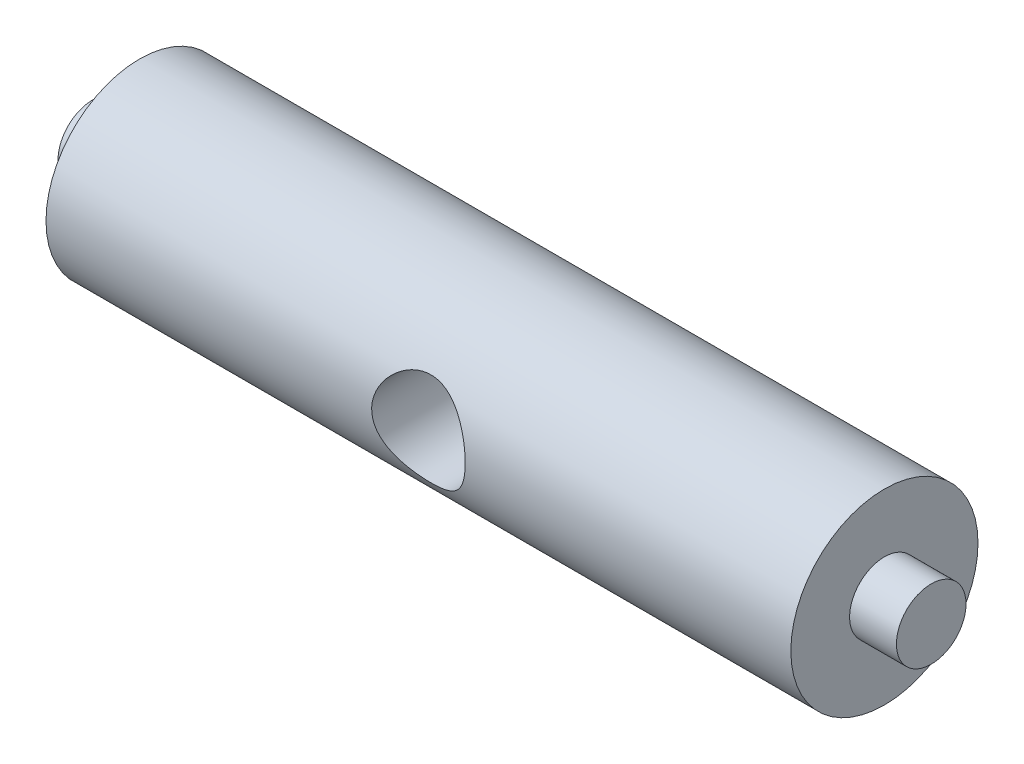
ISO-10303-21;
HEADER;
FILE_DESCRIPTION(('STEP AP214'),'2;1');
FILE_NAME('part.step','',(''),(''),'','','');
FILE_SCHEMA(('AUTOMOTIVE_DESIGN { 1 0 10303 214 1 1 1 1 }'));
ENDSEC;
DATA;
#1=APPLICATION_CONTEXT('core data for automotive mechanical design processes');
#2=APPLICATION_PROTOCOL_DEFINITION('international standard','automotive_design',2000,#1);
#3=PRODUCT_CONTEXT('',#1,'mechanical');
#4=PRODUCT('Part','Part','',(#3));
#5=PRODUCT_RELATED_PRODUCT_CATEGORY('part','',(#4));
#6=PRODUCT_DEFINITION_FORMATION('','',#4);
#7=PRODUCT_DEFINITION_CONTEXT('part definition',#1,'design');
#8=PRODUCT_DEFINITION('design','',#6,#7);
#9=PRODUCT_DEFINITION_SHAPE('','',#8);
#10=(LENGTH_UNIT() NAMED_UNIT(*) SI_UNIT(.MILLI.,.METRE.));
#11=(NAMED_UNIT(*) PLANE_ANGLE_UNIT() SI_UNIT($,.RADIAN.));
#12=(NAMED_UNIT(*) SI_UNIT($,.STERADIAN.) SOLID_ANGLE_UNIT());
#13=UNCERTAINTY_MEASURE_WITH_UNIT(LENGTH_MEASURE(1.E-05),#10,'distance_accuracy_value','');
#14=(GEOMETRIC_REPRESENTATION_CONTEXT(3) GLOBAL_UNCERTAINTY_ASSIGNED_CONTEXT((#13)) GLOBAL_UNIT_ASSIGNED_CONTEXT((#10,
#11,#12)) REPRESENTATION_CONTEXT('',''));
#15=CARTESIAN_POINT('',(0.,0.,0.));
#16=DIRECTION('',(0.,0.,1.));
#17=DIRECTION('',(1.,0.,0.));
#18=AXIS2_PLACEMENT_3D('',#15,#16,#17);
#19=CARTESIAN_POINT('',(-28.448,0.,0.));
#20=DIRECTION('',(1.,0.,0.));
#21=DIRECTION('',(0.,0.,-1.));
#22=AXIS2_PLACEMENT_3D('',#19,#20,#21);
#23=PLANE('',#22);
#24=CARTESIAN_POINT('',(-28.448,0.,0.));
#25=DIRECTION('',(1.,0.,0.));
#26=DIRECTION('',(0.,0.,-1.));
#27=AXIS2_PLACEMENT_3D('',#24,#25,#26);
#28=CIRCLE('',#27,2.36219999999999);
#29=CARTESIAN_POINT('',(-28.448,0.,-2.36219999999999));
#30=VERTEX_POINT('',#29);
#31=EDGE_CURVE('E48',#30,#30,#28,.T.);
#32=ORIENTED_EDGE('',*,*,#31,.F.);
#33=EDGE_LOOP('',(#32));
#34=FACE_BOUND('',#33,.T.);
#35=ADVANCED_FACE('F33',(#34),#23,.F.);
#36=CARTESIAN_POINT('',(82.5511759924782,0.,0.));
#37=DIRECTION('',(1.,0.,0.));
#38=DIRECTION('',(0.,0.,-1.));
#39=AXIS2_PLACEMENT_3D('',#36,#37,#38);
#40=CYLINDRICAL_SURFACE('',#39,2.36219999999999);
#41=CARTESIAN_POINT('',(-25.273,0.,0.));
#42=DIRECTION('',(1.,0.,0.));
#43=DIRECTION('',(0.,0.,-1.));
#44=AXIS2_PLACEMENT_3D('',#41,#42,#43);
#45=CIRCLE('',#44,2.36219999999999);
#46=CARTESIAN_POINT('',(-25.273,0.,-2.36219999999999));
#47=VERTEX_POINT('',#46);
#48=EDGE_CURVE('E52',#47,#47,#45,.T.);
#49=ORIENTED_EDGE('',*,*,#48,.F.);
#50=EDGE_LOOP('',(#49));
#51=FACE_BOUND('',#50,.T.);
#52=ORIENTED_EDGE('',*,*,#31,.T.);
#53=EDGE_LOOP('',(#52));
#54=FACE_BOUND('',#53,.T.);
#55=ADVANCED_FACE('F85',(#51,#54),#40,.T.);
#56=CARTESIAN_POINT('',(-25.273,-2.36219999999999,0.));
#57=DIRECTION('',(1.,0.,0.));
#58=DIRECTION('',(0.,0.,-1.));
#59=AXIS2_PLACEMENT_3D('',#56,#57,#58);
#60=PLANE('',#59);
#61=CARTESIAN_POINT('',(-25.273,0.,0.));
#62=DIRECTION('',(1.,0.,0.));
#63=DIRECTION('',(0.,0.,-1.));
#64=AXIS2_PLACEMENT_3D('',#61,#62,#63);
#65=CIRCLE('',#64,6.34999999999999);
#66=CARTESIAN_POINT('',(-25.273,0.,-6.34999999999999));
#67=VERTEX_POINT('',#66);
#68=EDGE_CURVE('E100',#67,#67,#65,.T.);
#69=ORIENTED_EDGE('',*,*,#68,.F.);
#70=EDGE_LOOP('',(#69));
#71=FACE_BOUND('',#70,.T.);
#72=ORIENTED_EDGE('',*,*,#48,.T.);
#73=EDGE_LOOP('',(#72));
#74=FACE_BOUND('',#73,.T.);
#75=ADVANCED_FACE('F81',(#71,#74),#60,.F.);
#76=CARTESIAN_POINT('',(82.5511759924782,0.,0.));
#77=DIRECTION('',(1.,0.,0.));
#78=DIRECTION('',(0.,0.,-1.));
#79=AXIS2_PLACEMENT_3D('',#76,#77,#78);
#80=CYLINDRICAL_SURFACE('',#79,6.34999999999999);
#81=CARTESIAN_POINT('',(-3.175,0.,-6.34999999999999));
#82=CARTESIAN_POINT('',(-3.17499911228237,-0.0834969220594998,-6.34999931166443));
#83=CARTESIAN_POINT('',(-3.17170012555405,-0.167002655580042,-6.348347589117));
#84=CARTESIAN_POINT('',(-3.15855412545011,-0.333378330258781,-6.34179105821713));
#85=CARTESIAN_POINT('',(-3.14870426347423,-0.416247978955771,-6.33688483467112));
#86=CARTESIAN_POINT('',(-3.10942793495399,-0.663182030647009,-6.31742426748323));
#87=CARTESIAN_POINT('',(-3.0702749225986,-0.825450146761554,-6.29812827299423));
#88=CARTESIAN_POINT('',(-2.96800928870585,-1.13965128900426,-6.24891823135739));
#89=CARTESIAN_POINT('',(-2.90498978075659,-1.29162180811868,-6.21904547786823));
#90=CARTESIAN_POINT('',(-2.7572639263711,-1.58264035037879,-6.15142812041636));
#91=CARTESIAN_POINT('',(-2.67255928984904,-1.72168939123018,-6.11368413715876));
#92=CARTESIAN_POINT('',(-2.47803037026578,-1.99234108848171,-6.0311109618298));
#93=CARTESIAN_POINT('',(-2.36699642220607,-2.12298433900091,-5.98599127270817));
#94=CARTESIAN_POINT('',(-2.12560331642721,-2.36467069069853,-5.89470535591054));
#95=CARTESIAN_POINT('',(-1.99522957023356,-2.47569885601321,-5.84853836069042));
#96=CARTESIAN_POINT('',(-1.70657905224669,-2.68368848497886,-5.75623634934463));
#97=CARTESIAN_POINT('',(-1.54692246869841,-2.77889135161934,-5.71038146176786));
#98=CARTESIAN_POINT('',(-1.29545201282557,-2.90019349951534,-5.64919759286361));
#99=CARTESIAN_POINT('',(-1.20959993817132,-2.93705266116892,-5.63006420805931));
#100=CARTESIAN_POINT('',(-1.03441438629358,-3.00322508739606,-5.59504604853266));
#101=CARTESIAN_POINT('',(-0.945083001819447,-3.03254280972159,-5.57915935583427));
#102=CARTESIAN_POINT('',(-0.768989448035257,-3.08174263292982,-5.55212611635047));
#103=CARTESIAN_POINT('',(-0.682389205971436,-3.10208128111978,-5.54075429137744));
#104=CARTESIAN_POINT('',(-0.507412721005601,-3.13545600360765,-5.52193654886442));
#105=CARTESIAN_POINT('',(-0.419037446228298,-3.14849595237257,-5.51448854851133));
#106=CARTESIAN_POINT('',(-0.241293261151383,-3.1670771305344,-5.50383875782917));
#107=CARTESIAN_POINT('',(-0.151924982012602,-3.1726228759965,-5.5006344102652));
#108=CARTESIAN_POINT('',(0.0269807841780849,-3.17614778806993,-5.49859788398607));
#109=CARTESIAN_POINT('',(0.116518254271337,-3.17412767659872,-5.49976528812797));
#110=CARTESIAN_POINT('',(0.362747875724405,-3.1581193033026,-5.50899190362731));
#111=CARTESIAN_POINT('',(0.518841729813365,-3.13621253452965,-5.52160857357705));
#112=CARTESIAN_POINT('',(0.82464664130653,-3.07003746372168,-5.55866493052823));
#113=CARTESIAN_POINT('',(0.974355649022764,-3.02576203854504,-5.58310838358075));
#114=CARTESIAN_POINT('',(1.26754429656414,-2.91531509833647,-5.64157885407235));
#115=CARTESIAN_POINT('',(1.41079760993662,-2.84865758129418,-5.67581583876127));
#116=CARTESIAN_POINT('',(1.68476608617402,-2.69570761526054,-5.75003268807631));
#117=CARTESIAN_POINT('',(1.81547557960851,-2.60940634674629,-5.79001512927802));
#118=CARTESIAN_POINT('',(2.07810427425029,-2.40685964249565,-5.87734289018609));
#119=CARTESIAN_POINT('',(2.2080753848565,-2.28820488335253,-5.92497898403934));
#120=CARTESIAN_POINT('',(2.44708514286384,-2.03058898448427,-6.01813700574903));
#121=CARTESIAN_POINT('',(2.5561137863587,-1.89161819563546,-6.06365791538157));
#122=CARTESIAN_POINT('',(2.75490191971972,-1.58913989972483,-6.15003810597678));
#123=CARTESIAN_POINT('',(2.84353148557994,-1.42479265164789,-6.19058274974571));
#124=CARTESIAN_POINT('',(2.99115808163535,-1.08098023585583,-6.2597627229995));
#125=CARTESIAN_POINT('',(3.05017864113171,-0.901527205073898,-6.28840750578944));
#126=CARTESIAN_POINT('',(3.13205940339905,-0.548533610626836,-6.32854759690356));
#127=CARTESIAN_POINT('',(3.15750967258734,-0.375734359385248,-6.34126679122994));
#128=CARTESIAN_POINT('',(3.17965052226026,-0.0278752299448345,-6.35231817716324));
#129=CARTESIAN_POINT('',(3.17635472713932,0.147183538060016,-6.35065718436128));
#130=CARTESIAN_POINT('',(3.14259376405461,0.48016468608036,-6.33384535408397));
#131=CARTESIAN_POINT('',(3.11425420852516,0.638363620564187,-6.31975005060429));
#132=CARTESIAN_POINT('',(3.03454412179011,0.947441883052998,-6.2808539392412));
#133=CARTESIAN_POINT('',(2.98317105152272,1.09832040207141,-6.25605195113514));
#134=CARTESIAN_POINT('',(2.8575048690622,1.39347133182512,-6.19709998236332));
#135=CARTESIAN_POINT('',(2.78259841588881,1.53743151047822,-6.16270299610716));
#136=CARTESIAN_POINT('',(2.61268357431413,1.8112148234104,-6.08787118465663));
#137=CARTESIAN_POINT('',(2.5176666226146,1.94103189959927,-6.04743378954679));
#138=CARTESIAN_POINT('',(2.29946064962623,2.19636241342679,-5.95973602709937));
#139=CARTESIAN_POINT('',(2.17442139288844,2.3202013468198,-5.91219559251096));
#140=CARTESIAN_POINT('',(1.90523764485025,2.54589381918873,-5.81858093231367));
#141=CARTESIAN_POINT('',(1.76108004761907,2.6477321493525,-5.77250773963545));
#142=CARTESIAN_POINT('',(1.44893139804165,2.83117262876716,-5.6848753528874));
#143=CARTESIAN_POINT('',(1.28012423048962,2.91155594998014,-5.64364281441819));
#144=CARTESIAN_POINT('',(0.92865553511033,3.04191297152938,-5.57447679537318));
#145=CARTESIAN_POINT('',(0.746012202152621,3.09192585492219,-5.54652618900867));
#146=CARTESIAN_POINT('',(0.390810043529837,3.15551086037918,-5.51057765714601));
#147=CARTESIAN_POINT('',(0.21896624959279,3.17212027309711,-5.50092192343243));
#148=CARTESIAN_POINT('',(-0.125244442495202,3.17718805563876,-5.49800001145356));
#149=CARTESIAN_POINT('',(-0.297611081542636,3.16565862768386,-5.50472672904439));
#150=CARTESIAN_POINT('',(-0.620660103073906,3.11761548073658,-5.53205211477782));
#151=CARTESIAN_POINT('',(-0.771843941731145,3.08358651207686,-5.55126823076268));
#152=CARTESIAN_POINT('',(-1.06619083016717,2.99458164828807,-5.5997797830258));
#153=CARTESIAN_POINT('',(-1.2093512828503,2.93959901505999,-5.62907846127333));
#154=CARTESIAN_POINT('',(-1.49423369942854,2.8061154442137,-5.69685576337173));
#155=CARTESIAN_POINT('',(-1.63521280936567,2.72628260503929,-5.73581889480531));
#156=CARTESIAN_POINT('',(-1.9026974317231,2.54682759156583,-5.8177220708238));
#157=CARTESIAN_POINT('',(-2.0291953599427,2.44719512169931,-5.86066417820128));
#158=CARTESIAN_POINT('',(-2.28009752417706,2.21680287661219,-5.95192753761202));
#159=CARTESIAN_POINT('',(-2.40237975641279,2.08373188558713,-6.00026839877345));
#160=CARTESIAN_POINT('',(-2.62339787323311,1.79751265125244,-6.09212345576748));
#161=CARTESIAN_POINT('',(-2.72212106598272,1.64435365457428,-6.13563504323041));
#162=CARTESIAN_POINT('',(-2.85028026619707,1.40178715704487,-6.19391073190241));
#163=CARTESIAN_POINT('',(-2.88980058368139,1.31842200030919,-6.21223173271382));
#164=CARTESIAN_POINT('',(-2.9615994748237,1.14807701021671,-6.24595363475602));
#165=CARTESIAN_POINT('',(-2.99388160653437,1.06109897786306,-6.26135597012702));
#166=CARTESIAN_POINT('',(-3.050759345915,0.88436132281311,-6.28875097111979));
#167=CARTESIAN_POINT('',(-3.07537171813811,0.794608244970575,-6.30075106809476));
#168=CARTESIAN_POINT('',(-3.11666738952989,0.612925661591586,-6.32100983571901));
#169=CARTESIAN_POINT('',(-3.13335553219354,0.520997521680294,-6.32927079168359));
#170=CARTESIAN_POINT('',(-3.15561628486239,0.357531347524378,-6.34032503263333));
#171=CARTESIAN_POINT('',(-3.16287882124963,0.286274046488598,-6.34394670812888));
#172=CARTESIAN_POINT('',(-3.17257112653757,0.143346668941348,-6.34878452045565));
#173=CARTESIAN_POINT('',(-3.17500076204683,0.0716765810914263,-6.3500005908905));
#174=CARTESIAN_POINT('',(-3.175,0.,-6.34999999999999));
#175=B_SPLINE_CURVE_WITH_KNOTS('',3,(#81,#82,#83,#84,#85,#86,#87,#88,#89,#90,#91,#92,#93,#94,
#95,#96,#97,#98,#99,#100,#101,#102,#103,#104,#105,#106,#107,#108,#109,#110,#111,#112,#113,#114,
#115,#116,#117,#118,#119,#120,#121,#122,#123,#124,#125,#126,#127,#128,#129,#130,#131,#132,#133,
#134,#135,#136,#137,#138,#139,#140,#141,#142,#143,#144,#145,#146,#147,#148,#149,#150,#151,#152,
#153,#154,#155,#156,#157,#158,#159,#160,#161,#162,#163,#164,#165,#166,#167,#168,#169,#170,#171,
#172,#173,#174),.UNSPECIFIED.,.T.,.F.,(4,2,2,2,2,2,2,2,2,2,2,2,2,2,2,2,2,2,2,2,2,2,2,2,2,2,2,2,
2,2,2,2,2,2,2,2,2,2,2,2,2,2,2,2,2,2,4),(0.,0.25041561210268,0.500940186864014,1.00234854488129,
1.50182051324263,2.00125310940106,2.53090025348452,3.06094897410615,3.63210298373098,
3.91787290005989,4.20347350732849,4.47213270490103,4.74064915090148,5.00900371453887,
5.27733267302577,5.74927594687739,6.22136960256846,6.70445970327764,7.18776712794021,
7.73235646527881,8.27720530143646,8.84735553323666,9.41705196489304,9.93956405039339,
10.4618285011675,10.9436138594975,11.4254523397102,11.9210677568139,12.4168946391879,
12.9614122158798,13.5063050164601,14.0775857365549,14.6481278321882,15.1639000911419,
15.6794487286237,16.1458838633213,16.6124691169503,17.1104020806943,17.6085946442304,
18.1673210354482,18.7263477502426,19.0082017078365,19.2899168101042,19.5710117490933,
19.8519346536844,20.0668939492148,20.2818591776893),.UNSPECIFIED.);
#176=CARTESIAN_POINT('',(-3.175,0.,-6.34999999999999));
#177=VERTEX_POINT('',#176);
#178=EDGE_CURVE('E10',#177,#177,#175,.T.);
#179=ORIENTED_EDGE('',*,*,#178,.T.);
#180=EDGE_LOOP('',(#179));
#181=FACE_BOUND('',#180,.T.);
#182=CARTESIAN_POINT('',(3.175,0.,6.34999999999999));
#183=CARTESIAN_POINT('',(3.17499911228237,-0.0834969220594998,6.34999931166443));
#184=CARTESIAN_POINT('',(3.17170012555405,-0.167002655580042,6.348347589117));
#185=CARTESIAN_POINT('',(3.15855412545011,-0.333378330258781,6.34179105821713));
#186=CARTESIAN_POINT('',(3.14870426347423,-0.416247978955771,6.33688483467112));
#187=CARTESIAN_POINT('',(3.10942793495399,-0.663182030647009,6.31742426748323));
#188=CARTESIAN_POINT('',(3.0702749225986,-0.825450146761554,6.29812827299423));
#189=CARTESIAN_POINT('',(2.96800928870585,-1.13965128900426,6.24891823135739));
#190=CARTESIAN_POINT('',(2.90498978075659,-1.29162180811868,6.21904547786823));
#191=CARTESIAN_POINT('',(2.7572639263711,-1.58264035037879,6.15142812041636));
#192=CARTESIAN_POINT('',(2.67255928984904,-1.72168939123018,6.11368413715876));
#193=CARTESIAN_POINT('',(2.47803037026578,-1.99234108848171,6.0311109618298));
#194=CARTESIAN_POINT('',(2.36699642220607,-2.12298433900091,5.98599127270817));
#195=CARTESIAN_POINT('',(2.12560331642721,-2.36467069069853,5.89470535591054));
#196=CARTESIAN_POINT('',(1.99522957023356,-2.47569885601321,5.84853836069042));
#197=CARTESIAN_POINT('',(1.70657905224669,-2.68368848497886,5.75623634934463));
#198=CARTESIAN_POINT('',(1.54692246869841,-2.77889135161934,5.71038146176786));
#199=CARTESIAN_POINT('',(1.29545201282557,-2.90019349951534,5.64919759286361));
#200=CARTESIAN_POINT('',(1.20959993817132,-2.93705266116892,5.63006420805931));
#201=CARTESIAN_POINT('',(1.03441438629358,-3.00322508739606,5.59504604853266));
#202=CARTESIAN_POINT('',(0.945083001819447,-3.03254280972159,5.57915935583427));
#203=CARTESIAN_POINT('',(0.768989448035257,-3.08174263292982,5.55212611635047));
#204=CARTESIAN_POINT('',(0.682389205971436,-3.10208128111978,5.54075429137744));
#205=CARTESIAN_POINT('',(0.507412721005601,-3.13545600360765,5.52193654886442));
#206=CARTESIAN_POINT('',(0.419037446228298,-3.14849595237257,5.51448854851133));
#207=CARTESIAN_POINT('',(0.241293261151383,-3.1670771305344,5.50383875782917));
#208=CARTESIAN_POINT('',(0.151924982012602,-3.1726228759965,5.5006344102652));
#209=CARTESIAN_POINT('',(-0.0269807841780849,-3.17614778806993,5.49859788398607));
#210=CARTESIAN_POINT('',(-0.116518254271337,-3.17412767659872,5.49976528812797));
#211=CARTESIAN_POINT('',(-0.362747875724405,-3.1581193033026,5.50899190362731));
#212=CARTESIAN_POINT('',(-0.518841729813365,-3.13621253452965,5.52160857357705));
#213=CARTESIAN_POINT('',(-0.82464664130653,-3.07003746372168,5.55866493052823));
#214=CARTESIAN_POINT('',(-0.974355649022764,-3.02576203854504,5.58310838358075));
#215=CARTESIAN_POINT('',(-1.26754429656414,-2.91531509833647,5.64157885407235));
#216=CARTESIAN_POINT('',(-1.41079760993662,-2.84865758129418,5.67581583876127));
#217=CARTESIAN_POINT('',(-1.68476608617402,-2.69570761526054,5.75003268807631));
#218=CARTESIAN_POINT('',(-1.81547557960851,-2.60940634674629,5.79001512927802));
#219=CARTESIAN_POINT('',(-2.07810427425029,-2.40685964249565,5.87734289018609));
#220=CARTESIAN_POINT('',(-2.2080753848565,-2.28820488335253,5.92497898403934));
#221=CARTESIAN_POINT('',(-2.44708514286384,-2.03058898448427,6.01813700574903));
#222=CARTESIAN_POINT('',(-2.5561137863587,-1.89161819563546,6.06365791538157));
#223=CARTESIAN_POINT('',(-2.75490191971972,-1.58913989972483,6.15003810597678));
#224=CARTESIAN_POINT('',(-2.84353148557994,-1.42479265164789,6.19058274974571));
#225=CARTESIAN_POINT('',(-2.99115808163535,-1.08098023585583,6.2597627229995));
#226=CARTESIAN_POINT('',(-3.05017864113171,-0.901527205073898,6.28840750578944));
#227=CARTESIAN_POINT('',(-3.13205940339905,-0.548533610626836,6.32854759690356));
#228=CARTESIAN_POINT('',(-3.15750967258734,-0.375734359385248,6.34126679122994));
#229=CARTESIAN_POINT('',(-3.17965052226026,-0.0278752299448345,6.35231817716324));
#230=CARTESIAN_POINT('',(-3.17635472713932,0.147183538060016,6.35065718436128));
#231=CARTESIAN_POINT('',(-3.14259376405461,0.48016468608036,6.33384535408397));
#232=CARTESIAN_POINT('',(-3.11425420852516,0.638363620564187,6.31975005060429));
#233=CARTESIAN_POINT('',(-3.03454412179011,0.947441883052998,6.2808539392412));
#234=CARTESIAN_POINT('',(-2.98317105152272,1.09832040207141,6.25605195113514));
#235=CARTESIAN_POINT('',(-2.8575048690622,1.39347133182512,6.19709998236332));
#236=CARTESIAN_POINT('',(-2.78259841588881,1.53743151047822,6.16270299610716));
#237=CARTESIAN_POINT('',(-2.61268357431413,1.8112148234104,6.08787118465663));
#238=CARTESIAN_POINT('',(-2.5176666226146,1.94103189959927,6.04743378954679));
#239=CARTESIAN_POINT('',(-2.29946064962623,2.19636241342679,5.95973602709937));
#240=CARTESIAN_POINT('',(-2.17442139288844,2.3202013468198,5.91219559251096));
#241=CARTESIAN_POINT('',(-1.90523764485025,2.54589381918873,5.81858093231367));
#242=CARTESIAN_POINT('',(-1.76108004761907,2.6477321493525,5.77250773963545));
#243=CARTESIAN_POINT('',(-1.44893139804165,2.83117262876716,5.6848753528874));
#244=CARTESIAN_POINT('',(-1.28012423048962,2.91155594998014,5.64364281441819));
#245=CARTESIAN_POINT('',(-0.92865553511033,3.04191297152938,5.57447679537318));
#246=CARTESIAN_POINT('',(-0.746012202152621,3.09192585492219,5.54652618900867));
#247=CARTESIAN_POINT('',(-0.390810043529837,3.15551086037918,5.51057765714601));
#248=CARTESIAN_POINT('',(-0.21896624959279,3.17212027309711,5.50092192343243));
#249=CARTESIAN_POINT('',(0.125244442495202,3.17718805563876,5.49800001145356));
#250=CARTESIAN_POINT('',(0.297611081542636,3.16565862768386,5.50472672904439));
#251=CARTESIAN_POINT('',(0.620660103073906,3.11761548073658,5.53205211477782));
#252=CARTESIAN_POINT('',(0.771843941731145,3.08358651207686,5.55126823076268));
#253=CARTESIAN_POINT('',(1.06619083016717,2.99458164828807,5.5997797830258));
#254=CARTESIAN_POINT('',(1.2093512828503,2.93959901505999,5.62907846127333));
#255=CARTESIAN_POINT('',(1.49423369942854,2.8061154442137,5.69685576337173));
#256=CARTESIAN_POINT('',(1.63521280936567,2.72628260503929,5.73581889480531));
#257=CARTESIAN_POINT('',(1.9026974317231,2.54682759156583,5.8177220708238));
#258=CARTESIAN_POINT('',(2.0291953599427,2.44719512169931,5.86066417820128));
#259=CARTESIAN_POINT('',(2.28009752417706,2.21680287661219,5.95192753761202));
#260=CARTESIAN_POINT('',(2.40237975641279,2.08373188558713,6.00026839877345));
#261=CARTESIAN_POINT('',(2.62339787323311,1.79751265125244,6.09212345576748));
#262=CARTESIAN_POINT('',(2.72212106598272,1.64435365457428,6.13563504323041));
#263=CARTESIAN_POINT('',(2.85028026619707,1.40178715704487,6.19391073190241));
#264=CARTESIAN_POINT('',(2.88980058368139,1.31842200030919,6.21223173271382));
#265=CARTESIAN_POINT('',(2.9615994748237,1.14807701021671,6.24595363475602));
#266=CARTESIAN_POINT('',(2.99388160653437,1.06109897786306,6.26135597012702));
#267=CARTESIAN_POINT('',(3.050759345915,0.88436132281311,6.28875097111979));
#268=CARTESIAN_POINT('',(3.07537171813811,0.794608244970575,6.30075106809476));
#269=CARTESIAN_POINT('',(3.11666738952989,0.612925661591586,6.32100983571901));
#270=CARTESIAN_POINT('',(3.13335553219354,0.520997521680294,6.32927079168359));
#271=CARTESIAN_POINT('',(3.15561628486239,0.357531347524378,6.34032503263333));
#272=CARTESIAN_POINT('',(3.16287882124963,0.286274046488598,6.34394670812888));
#273=CARTESIAN_POINT('',(3.17257112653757,0.143346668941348,6.34878452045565));
#274=CARTESIAN_POINT('',(3.17500076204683,0.0716765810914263,6.3500005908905));
#275=CARTESIAN_POINT('',(3.175,0.,6.34999999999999));
#276=B_SPLINE_CURVE_WITH_KNOTS('',3,(#182,#183,#184,#185,#186,#187,#188,#189,#190,#191,#192,
#193,#194,#195,#196,#197,#198,#199,#200,#201,#202,#203,#204,#205,#206,#207,#208,#209,#210,#211,
#212,#213,#214,#215,#216,#217,#218,#219,#220,#221,#222,#223,#224,#225,#226,#227,#228,#229,#230,
#231,#232,#233,#234,#235,#236,#237,#238,#239,#240,#241,#242,#243,#244,#245,#246,#247,#248,#249,
#250,#251,#252,#253,#254,#255,#256,#257,#258,#259,#260,#261,#262,#263,#264,#265,#266,#267,#268,
#269,#270,#271,#272,#273,#274,#275),.UNSPECIFIED.,.T.,.F.,(4,2,2,2,2,2,2,2,2,2,2,2,2,2,2,2,2,2,
2,2,2,2,2,2,2,2,2,2,2,2,2,2,2,2,2,2,2,2,2,2,2,2,2,2,2,2,4),(0.,0.25041561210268,
0.500940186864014,1.00234854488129,1.50182051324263,2.00125310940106,2.53090025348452,
3.06094897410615,3.63210298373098,3.91787290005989,4.20347350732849,4.47213270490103,
4.74064915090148,5.00900371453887,5.27733267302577,5.74927594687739,6.22136960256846,
6.70445970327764,7.18776712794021,7.73235646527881,8.27720530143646,8.84735553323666,
9.41705196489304,9.93956405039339,10.4618285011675,10.9436138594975,11.4254523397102,
11.9210677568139,12.4168946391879,12.9614122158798,13.5063050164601,14.0775857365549,
14.6481278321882,15.1639000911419,15.6794487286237,16.1458838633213,16.6124691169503,
17.1104020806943,17.6085946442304,18.1673210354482,18.7263477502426,19.0082017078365,
19.2899168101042,19.5710117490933,19.8519346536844,20.0668939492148,20.2818591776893),.UNSPECIFIED.);
#277=CARTESIAN_POINT('',(3.175,0.,6.34999999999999));
#278=VERTEX_POINT('',#277);
#279=EDGE_CURVE('E44',#278,#278,#276,.T.);
#280=ORIENTED_EDGE('',*,*,#279,.T.);
#281=EDGE_LOOP('',(#280));
#282=FACE_BOUND('',#281,.T.);
#283=CARTESIAN_POINT('',(25.273,0.,0.));
#284=DIRECTION('',(1.,0.,0.));
#285=DIRECTION('',(0.,0.,-1.));
#286=AXIS2_PLACEMENT_3D('',#283,#284,#285);
#287=CIRCLE('',#286,6.34999999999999);
#288=CARTESIAN_POINT('',(25.273,0.,-6.34999999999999));
#289=VERTEX_POINT('',#288);
#290=EDGE_CURVE('E102',#289,#289,#287,.T.);
#291=ORIENTED_EDGE('',*,*,#290,.F.);
#292=EDGE_LOOP('',(#291));
#293=FACE_BOUND('',#292,.T.);
#294=ORIENTED_EDGE('',*,*,#68,.T.);
#295=EDGE_LOOP('',(#294));
#296=FACE_BOUND('',#295,.T.);
#297=ADVANCED_FACE('F58',(#181,#282,#293,#296),#80,.T.);
#298=CARTESIAN_POINT('',(25.273,-6.34999999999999,0.));
#299=DIRECTION('',(-1.,0.,0.));
#300=DIRECTION('',(0.,0.,1.));
#301=AXIS2_PLACEMENT_3D('',#298,#299,#300);
#302=PLANE('',#301);
#303=CARTESIAN_POINT('',(25.273,0.,0.));
#304=DIRECTION('',(1.,0.,0.));
#305=DIRECTION('',(0.,0.,-1.));
#306=AXIS2_PLACEMENT_3D('',#303,#304,#305);
#307=CIRCLE('',#306,2.3622);
#308=CARTESIAN_POINT('',(25.273,0.,-2.3622));
#309=VERTEX_POINT('',#308);
#310=EDGE_CURVE('E107',#309,#309,#307,.T.);
#311=ORIENTED_EDGE('',*,*,#310,.F.);
#312=EDGE_LOOP('',(#311));
#313=FACE_BOUND('',#312,.T.);
#314=ORIENTED_EDGE('',*,*,#290,.T.);
#315=EDGE_LOOP('',(#314));
#316=FACE_BOUND('',#315,.T.);
#317=ADVANCED_FACE('F74',(#313,#316),#302,.F.);
#318=CARTESIAN_POINT('',(82.5511759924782,0.,0.));
#319=DIRECTION('',(1.,0.,0.));
#320=DIRECTION('',(0.,0.,-1.));
#321=AXIS2_PLACEMENT_3D('',#318,#319,#320);
#322=CYLINDRICAL_SURFACE('',#321,2.3622);
#323=CARTESIAN_POINT('',(28.448,0.,0.));
#324=DIRECTION('',(1.,0.,0.));
#325=DIRECTION('',(0.,0.,-1.));
#326=AXIS2_PLACEMENT_3D('',#323,#324,#325);
#327=CIRCLE('',#326,2.36219999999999);
#328=CARTESIAN_POINT('',(28.448,0.,-2.36219999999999));
#329=VERTEX_POINT('',#328);
#330=EDGE_CURVE('E110',#329,#329,#327,.T.);
#331=ORIENTED_EDGE('',*,*,#330,.F.);
#332=EDGE_LOOP('',(#331));
#333=FACE_BOUND('',#332,.T.);
#334=ORIENTED_EDGE('',*,*,#310,.T.);
#335=EDGE_LOOP('',(#334));
#336=FACE_BOUND('',#335,.T.);
#337=ADVANCED_FACE('F71',(#333,#336),#322,.T.);
#338=CARTESIAN_POINT('',(28.448,-2.36219999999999,0.));
#339=DIRECTION('',(-1.,0.,0.));
#340=DIRECTION('',(0.,0.,1.));
#341=AXIS2_PLACEMENT_3D('',#338,#339,#340);
#342=PLANE('',#341);
#343=ORIENTED_EDGE('',*,*,#330,.T.);
#344=EDGE_LOOP('',(#343));
#345=FACE_BOUND('',#344,.T.);
#346=ADVANCED_FACE('F66',(#345),#342,.F.);
#347=CARTESIAN_POINT('',(0.,0.,-6.34999999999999));
#348=DIRECTION('',(0.,0.,1.));
#349=DIRECTION('',(1.,0.,0.));
#350=AXIS2_PLACEMENT_3D('',#347,#348,#349);
#351=CYLINDRICAL_SURFACE('',#350,3.175);
#352=ORIENTED_EDGE('',*,*,#279,.F.);
#353=EDGE_LOOP('',(#352));
#354=FACE_BOUND('',#353,.T.);
#355=ORIENTED_EDGE('',*,*,#178,.F.);
#356=EDGE_LOOP('',(#355));
#357=FACE_BOUND('',#356,.T.);
#358=ADVANCED_FACE('F62',(#354,#357),#351,.F.);
#359=CLOSED_SHELL('',(#35,#55,#75,#297,#317,#337,#346,#358));
#360=MANIFOLD_SOLID_BREP('B2',#359);
#361=ADVANCED_BREP_SHAPE_REPRESENTATION('',(#18,#360),#14);
#362=SHAPE_DEFINITION_REPRESENTATION(#9,#361);
ENDSEC;
END-ISO-10303-21;
